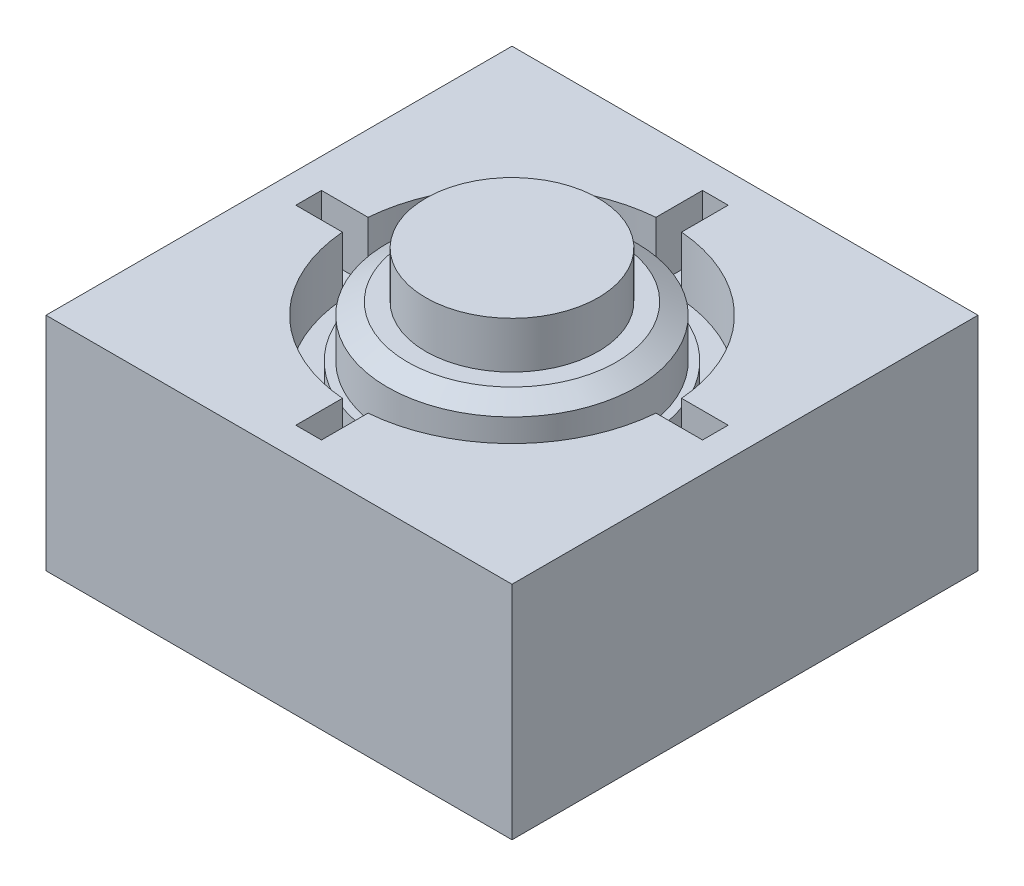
from build123d import *

# Parameters (mm, degrees)
SKETCH1_W           = 20
SKETCH1_H           = 20
BOSS_EXTRUDE1_DEPTH = 10
SKETCH3_R           = 6.75
SKETCH3_R_2         = 5.35
CUT_EXTRUDE1_DEPTH  = 3
SKETCH5_R           = 5.7
BOSS_EXTRUDE2_DEPTH = 0.8
SKETCH6_W           = 1.1
SKETCH6_H           = 2
CUT_EXTRUDE2_DEPTH  = 3
CIRPATTERN1_COUNT   = 2
CIRPATTERN1_ANGLE   = 90
CHAMFER1_SIZE       = 0.5
CHAMFER1_SIZE2      = 0.866025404
SKETCH9_R           = 3.7
BOSS_EXTRUDE3_DEPTH = 2
SKETCH11_W          = 20.64797292
SKETCH11_H          = 20.801375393
SKETCH11_R          = 5.35
CUT_EXTRUDE3_DEPTH  = 2.5


with BuildPart() as part:
    # Sketch1 → Boss-Extrude1 (new body)
    with BuildSketch(Plane(origin=(0, 0, 0), x_dir=(1, 0, 0), z_dir=(0, 1, 0))):
        Rectangle(SKETCH1_W, SKETCH1_H)
    extrude(amount=BOSS_EXTRUDE1_DEPTH)

    # Sketch3 → Cut-Extrude1 (cut)
    with BuildSketch(Plane(origin=(0, 10, 0), x_dir=(1, 0, 0), z_dir=(0, 1, 0))):
        with Locations(Location((0, 0, 0), (0, 0, 270))):
            Circle(SKETCH3_R)
        with Locations(Location((0, 0, 0), (0, 0, 270))):
            Circle(SKETCH3_R_2, mode=Mode.SUBTRACT)
    extrude(amount=-CUT_EXTRUDE1_DEPTH, mode=Mode.SUBTRACT)

    # Sketch5 → Boss-Extrude2 (add)
    with BuildSketch(Plane(origin=(0, 7, 0), x_dir=(1, 0, 0), z_dir=(0, 1, 0))):
        with Locations(Location((0, 0, 0), (0, 0, 270))):
            Circle(SKETCH5_R)
    extrude(amount=BOSS_EXTRUDE2_DEPTH)

    # Sketch6 → Cut-Extrude2 (cut)
    with BuildSketch(Plane(origin=(0, 10, 0), x_dir=(1, 0, 0), z_dir=(0, 1, 0))):
        with Locations((0, 7.727555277)):
            Rectangle(SKETCH6_W, SKETCH6_H)
        with Locations((0, -7.727555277)):
            Rectangle(SKETCH6_W, SKETCH6_H)
    cut_extrude2 = extrude(amount=-CUT_EXTRUDE2_DEPTH, mode=Mode.SUBTRACT)

    # CirPattern1: Cut-Extrude2 ×2 about axis
    cirpattern1_axis = Axis((0, 0, 0), (0, -1, 0))
    for i in range(1, CIRPATTERN1_COUNT):
        add(cut_extrude2.rotate(cirpattern1_axis, i * CIRPATTERN1_ANGLE / (CIRPATTERN1_COUNT - 1)), mode=Mode.SUBTRACT)

    # Chamfer1
    chamfer1_edges = [part.edges().sort_by_distance(p)[0] for p in [
        (0, 10, -5.35),
    ]]
    chamfer1_side = [part.faces().sort_by_distance(p)[0] for p in [
        (0, 8.9, -5.35),
    ]]
    chamfer(chamfer1_edges, length=CHAMFER1_SIZE, length2=CHAMFER1_SIZE2, reference=chamfer1_side[0])

    # Sketch9 → Boss-Extrude3 (add)
    with BuildSketch(Plane(origin=(0, 10, 0), x_dir=(1, 0, 0), z_dir=(0, 1, 0))):
        with Locations(Location((0, 0, 0), (0, 0, 270))):
            Circle(SKETCH9_R)
    extrude(amount=BOSS_EXTRUDE3_DEPTH)

    # Sketch11 → Cut-Extrude3 (cut)
    with BuildSketch(Plane(origin=(0, 12, 0), x_dir=(1, 0, 0), z_dir=(0, 1, 0))):
        with Locations((-0.046020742, -0.015340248)):
            Rectangle(SKETCH11_W, SKETCH11_H)
        with Locations(Location((0, 0, 0), (0, 0, 270))):
            Circle(SKETCH11_R, mode=Mode.SUBTRACT)
    extrude(amount=-CUT_EXTRUDE3_DEPTH, mode=Mode.SUBTRACT)


solid = part.part
